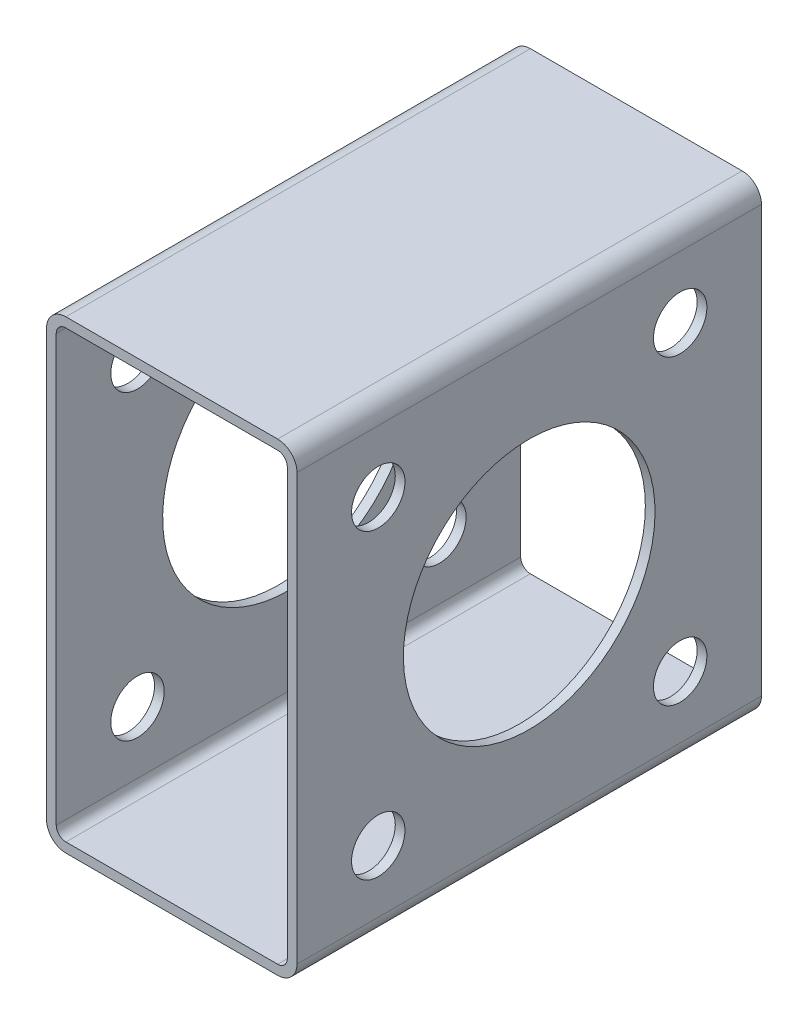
ISO-10303-21;
HEADER;
FILE_DESCRIPTION(('STEP AP214'),'2;1');
FILE_NAME('part.step','',(''),(''),'','','');
FILE_SCHEMA(('AUTOMOTIVE_DESIGN { 1 0 10303 214 1 1 1 1 }'));
ENDSEC;
DATA;
#1=APPLICATION_CONTEXT('core data for automotive mechanical design processes');
#2=APPLICATION_PROTOCOL_DEFINITION('international standard','automotive_design',2000,#1);
#3=PRODUCT_CONTEXT('',#1,'mechanical');
#4=PRODUCT('Part','Part','',(#3));
#5=PRODUCT_RELATED_PRODUCT_CATEGORY('part','',(#4));
#6=PRODUCT_DEFINITION_FORMATION('','',#4);
#7=PRODUCT_DEFINITION_CONTEXT('part definition',#1,'design');
#8=PRODUCT_DEFINITION('design','',#6,#7);
#9=PRODUCT_DEFINITION_SHAPE('','',#8);
#10=(LENGTH_UNIT() NAMED_UNIT(*) SI_UNIT(.MILLI.,.METRE.));
#11=(NAMED_UNIT(*) PLANE_ANGLE_UNIT() SI_UNIT($,.RADIAN.));
#12=(NAMED_UNIT(*) SI_UNIT($,.STERADIAN.) SOLID_ANGLE_UNIT());
#13=UNCERTAINTY_MEASURE_WITH_UNIT(LENGTH_MEASURE(1.E-05),#10,'distance_accuracy_value','');
#14=(GEOMETRIC_REPRESENTATION_CONTEXT(3) GLOBAL_UNCERTAINTY_ASSIGNED_CONTEXT((#13)) GLOBAL_UNIT_ASSIGNED_CONTEXT((#10,
#11,#12)) REPRESENTATION_CONTEXT('',''));
#15=CARTESIAN_POINT('',(0.,0.,0.));
#16=DIRECTION('',(0.,0.,1.));
#17=DIRECTION('',(1.,0.,0.));
#18=AXIS2_PLACEMENT_3D('',#15,#16,#17);
#19=CARTESIAN_POINT('',(-31.75,-69.85,152.4));
#20=DIRECTION('',(0.,0.,1.));
#21=DIRECTION('',(1.,0.,0.));
#22=AXIS2_PLACEMENT_3D('',#19,#20,#21);
#23=PLANE('',#22);
#24=CARTESIAN_POINT('',(-31.75,-69.85,152.4));
#25=DIRECTION('',(0.,0.,1.));
#26=DIRECTION('',(1.,0.,0.));
#27=AXIS2_PLACEMENT_3D('',#24,#25,#26);
#28=CIRCLE('',#27,6.35);
#29=CARTESIAN_POINT('',(-38.1,-69.85,152.4));
#30=VERTEX_POINT('',#29);
#31=CARTESIAN_POINT('',(-31.75,-76.2,152.4));
#32=VERTEX_POINT('',#31);
#33=EDGE_CURVE('E210',#30,#32,#28,.T.);
#34=ORIENTED_EDGE('',*,*,#33,.T.);
#35=DIRECTION('',(1.,0.,0.));
#36=VECTOR('',#35,1.);
#37=CARTESIAN_POINT('',(-31.75,-76.2,152.4));
#38=LINE('',#37,#36);
#39=CARTESIAN_POINT('',(37.719,-76.2,152.4));
#40=VERTEX_POINT('',#39);
#41=EDGE_CURVE('E213',#32,#40,#38,.T.);
#42=ORIENTED_EDGE('',*,*,#41,.T.);
#43=CARTESIAN_POINT('',(37.719,-69.85,152.4));
#44=DIRECTION('',(0.,0.,1.));
#45=DIRECTION('',(-1.,0.,0.));
#46=AXIS2_PLACEMENT_3D('',#43,#44,#45);
#47=CIRCLE('',#46,6.35);
#48=CARTESIAN_POINT('',(44.069,-69.85,152.4));
#49=VERTEX_POINT('',#48);
#50=EDGE_CURVE('E216',#40,#49,#47,.T.);
#51=ORIENTED_EDGE('',*,*,#50,.T.);
#52=DIRECTION('',(0.,1.,0.));
#53=VECTOR('',#52,1.);
#54=CARTESIAN_POINT('',(44.069,-69.85,152.4));
#55=LINE('',#54,#53);
#56=CARTESIAN_POINT('',(44.069,69.85,152.4));
#57=VERTEX_POINT('',#56);
#58=EDGE_CURVE('E218',#49,#57,#55,.T.);
#59=ORIENTED_EDGE('',*,*,#58,.T.);
#60=CARTESIAN_POINT('',(37.719,69.85,152.4));
#61=DIRECTION('',(0.,0.,1.));
#62=DIRECTION('',(1.,0.,0.));
#63=AXIS2_PLACEMENT_3D('',#60,#61,#62);
#64=CIRCLE('',#63,6.35);
#65=CARTESIAN_POINT('',(37.719,76.2,152.4));
#66=VERTEX_POINT('',#65);
#67=EDGE_CURVE('E220',#57,#66,#64,.T.);
#68=ORIENTED_EDGE('',*,*,#67,.T.);
#69=DIRECTION('',(-1.,0.,0.));
#70=VECTOR('',#69,1.);
#71=CARTESIAN_POINT('',(-31.75,76.2,152.4));
#72=LINE('',#71,#70);
#73=CARTESIAN_POINT('',(-31.75,76.2,152.4));
#74=VERTEX_POINT('',#73);
#75=EDGE_CURVE('E222',#66,#74,#72,.T.);
#76=ORIENTED_EDGE('',*,*,#75,.T.);
#77=CARTESIAN_POINT('',(-31.75,69.85,152.4));
#78=DIRECTION('',(0.,0.,1.));
#79=DIRECTION('',(1.,0.,0.));
#80=AXIS2_PLACEMENT_3D('',#77,#78,#79);
#81=CIRCLE('',#80,6.34999999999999);
#82=CARTESIAN_POINT('',(-38.1,69.85,152.4));
#83=VERTEX_POINT('',#82);
#84=EDGE_CURVE('E224',#74,#83,#81,.T.);
#85=ORIENTED_EDGE('',*,*,#84,.T.);
#86=DIRECTION('',(0.,-1.,0.));
#87=VECTOR('',#86,1.);
#88=CARTESIAN_POINT('',(-38.1,-69.85,152.4));
#89=LINE('',#88,#87);
#90=EDGE_CURVE('E226',#83,#30,#89,.T.);
#91=ORIENTED_EDGE('',*,*,#90,.T.);
#92=EDGE_LOOP('',(#34,#42,#51,#59,#68,#76,#85,#91));
#93=FACE_BOUND('',#92,.T.);
#94=DIRECTION('',(1.,0.,0.));
#95=VECTOR('',#94,1.);
#96=CARTESIAN_POINT('',(-31.75,-73.025,152.4));
#97=LINE('',#96,#95);
#98=CARTESIAN_POINT('',(-31.75,-73.025,152.4));
#99=VERTEX_POINT('',#98);
#100=CARTESIAN_POINT('',(37.719,-73.025,152.4));
#101=VERTEX_POINT('',#100);
#102=EDGE_CURVE('E151',#99,#101,#97,.T.);
#103=ORIENTED_EDGE('',*,*,#102,.F.);
#104=CARTESIAN_POINT('',(-31.75,-69.85,152.4));
#105=DIRECTION('',(0.,0.,1.));
#106=DIRECTION('',(1.,0.,0.));
#107=AXIS2_PLACEMENT_3D('',#104,#105,#106);
#108=CIRCLE('',#107,3.17500000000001);
#109=CARTESIAN_POINT('',(-34.925,-69.85,152.4));
#110=VERTEX_POINT('',#109);
#111=EDGE_CURVE('E143',#110,#99,#108,.T.);
#112=ORIENTED_EDGE('',*,*,#111,.F.);
#113=DIRECTION('',(0.,-1.,0.));
#114=VECTOR('',#113,1.);
#115=CARTESIAN_POINT('',(-34.925,-69.85,152.4));
#116=LINE('',#115,#114);
#117=CARTESIAN_POINT('',(-34.925,69.85,152.4));
#118=VERTEX_POINT('',#117);
#119=EDGE_CURVE('E177',#118,#110,#116,.T.);
#120=ORIENTED_EDGE('',*,*,#119,.F.);
#121=CARTESIAN_POINT('',(-31.75,69.85,152.4));
#122=DIRECTION('',(0.,0.,1.));
#123=DIRECTION('',(1.,0.,0.));
#124=AXIS2_PLACEMENT_3D('',#121,#122,#123);
#125=CIRCLE('',#124,3.175);
#126=CARTESIAN_POINT('',(-31.75,73.025,152.4));
#127=VERTEX_POINT('',#126);
#128=EDGE_CURVE('E175',#127,#118,#125,.T.);
#129=ORIENTED_EDGE('',*,*,#128,.F.);
#130=DIRECTION('',(-1.,0.,0.));
#131=VECTOR('',#130,1.);
#132=CARTESIAN_POINT('',(-31.75,73.025,152.4));
#133=LINE('',#132,#131);
#134=CARTESIAN_POINT('',(37.719,73.025,152.4));
#135=VERTEX_POINT('',#134);
#136=EDGE_CURVE('E173',#135,#127,#133,.T.);
#137=ORIENTED_EDGE('',*,*,#136,.F.);
#138=CARTESIAN_POINT('',(37.719,69.85,152.4));
#139=DIRECTION('',(0.,0.,1.));
#140=DIRECTION('',(1.,0.,0.));
#141=AXIS2_PLACEMENT_3D('',#138,#139,#140);
#142=CIRCLE('',#141,3.175);
#143=CARTESIAN_POINT('',(40.894,69.85,152.4));
#144=VERTEX_POINT('',#143);
#145=EDGE_CURVE('E171',#144,#135,#142,.T.);
#146=ORIENTED_EDGE('',*,*,#145,.F.);
#147=DIRECTION('',(0.,1.,0.));
#148=VECTOR('',#147,1.);
#149=CARTESIAN_POINT('',(40.894,-69.85,152.4));
#150=LINE('',#149,#148);
#151=CARTESIAN_POINT('',(40.894,-69.85,152.4));
#152=VERTEX_POINT('',#151);
#153=EDGE_CURVE('E166',#152,#144,#150,.T.);
#154=ORIENTED_EDGE('',*,*,#153,.F.);
#155=CARTESIAN_POINT('',(37.719,-69.85,152.4));
#156=DIRECTION('',(0.,0.,1.));
#157=DIRECTION('',(-1.,0.,0.));
#158=AXIS2_PLACEMENT_3D('',#155,#156,#157);
#159=CIRCLE('',#158,3.17499999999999);
#160=EDGE_CURVE('E164',#101,#152,#159,.T.);
#161=ORIENTED_EDGE('',*,*,#160,.F.);
#162=EDGE_LOOP('',(#103,#112,#120,#129,#137,#146,#154,#161));
#163=FACE_BOUND('',#162,.T.);
#164=ADVANCED_FACE('F30',(#93,#163),#23,.T.);
#165=CARTESIAN_POINT('',(-31.75,-69.85,0.));
#166=DIRECTION('',(0.,0.,1.));
#167=DIRECTION('',(1.,0.,0.));
#168=AXIS2_PLACEMENT_3D('',#165,#166,#167);
#169=PLANE('',#168);
#170=CARTESIAN_POINT('',(-31.75,-69.85,0.));
#171=DIRECTION('',(0.,0.,1.));
#172=DIRECTION('',(1.,0.,0.));
#173=AXIS2_PLACEMENT_3D('',#170,#171,#172);
#174=CIRCLE('',#173,6.35);
#175=CARTESIAN_POINT('',(-38.1,-69.85,0.));
#176=VERTEX_POINT('',#175);
#177=CARTESIAN_POINT('',(-31.75,-76.2,0.));
#178=VERTEX_POINT('',#177);
#179=EDGE_CURVE('E159',#176,#178,#174,.T.);
#180=ORIENTED_EDGE('',*,*,#179,.F.);
#181=DIRECTION('',(0.,-1.,0.));
#182=VECTOR('',#181,1.);
#183=CARTESIAN_POINT('',(-38.1,-69.85,0.));
#184=LINE('',#183,#182);
#185=CARTESIAN_POINT('',(-38.1,69.85,0.));
#186=VERTEX_POINT('',#185);
#187=EDGE_CURVE('E214',#186,#176,#184,.T.);
#188=ORIENTED_EDGE('',*,*,#187,.F.);
#189=CARTESIAN_POINT('',(-31.75,69.85,0.));
#190=DIRECTION('',(0.,0.,1.));
#191=DIRECTION('',(1.,0.,0.));
#192=AXIS2_PLACEMENT_3D('',#189,#190,#191);
#193=CIRCLE('',#192,6.34999999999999);
#194=CARTESIAN_POINT('',(-31.75,76.2,0.));
#195=VERTEX_POINT('',#194);
#196=EDGE_CURVE('E241',#195,#186,#193,.T.);
#197=ORIENTED_EDGE('',*,*,#196,.F.);
#198=DIRECTION('',(-1.,0.,0.));
#199=VECTOR('',#198,1.);
#200=CARTESIAN_POINT('',(-31.75,76.2,0.));
#201=LINE('',#200,#199);
#202=CARTESIAN_POINT('',(37.719,76.2,0.));
#203=VERTEX_POINT('',#202);
#204=EDGE_CURVE('E239',#203,#195,#201,.T.);
#205=ORIENTED_EDGE('',*,*,#204,.F.);
#206=CARTESIAN_POINT('',(37.719,69.85,0.));
#207=DIRECTION('',(0.,0.,1.));
#208=DIRECTION('',(1.,0.,0.));
#209=AXIS2_PLACEMENT_3D('',#206,#207,#208);
#210=CIRCLE('',#209,6.35);
#211=CARTESIAN_POINT('',(44.069,69.85,0.));
#212=VERTEX_POINT('',#211);
#213=EDGE_CURVE('E237',#212,#203,#210,.T.);
#214=ORIENTED_EDGE('',*,*,#213,.F.);
#215=DIRECTION('',(0.,1.,0.));
#216=VECTOR('',#215,1.);
#217=CARTESIAN_POINT('',(44.069,-69.85,0.));
#218=LINE('',#217,#216);
#219=CARTESIAN_POINT('',(44.069,-69.85,0.));
#220=VERTEX_POINT('',#219);
#221=EDGE_CURVE('E235',#220,#212,#218,.T.);
#222=ORIENTED_EDGE('',*,*,#221,.F.);
#223=CARTESIAN_POINT('',(37.719,-69.85,0.));
#224=DIRECTION('',(0.,0.,1.));
#225=DIRECTION('',(-1.,0.,0.));
#226=AXIS2_PLACEMENT_3D('',#223,#224,#225);
#227=CIRCLE('',#226,6.35);
#228=CARTESIAN_POINT('',(37.719,-76.2,0.));
#229=VERTEX_POINT('',#228);
#230=EDGE_CURVE('E233',#229,#220,#227,.T.);
#231=ORIENTED_EDGE('',*,*,#230,.F.);
#232=DIRECTION('',(1.,0.,0.));
#233=VECTOR('',#232,1.);
#234=CARTESIAN_POINT('',(-31.75,-76.2,0.));
#235=LINE('',#234,#233);
#236=EDGE_CURVE('E231',#178,#229,#235,.T.);
#237=ORIENTED_EDGE('',*,*,#236,.F.);
#238=EDGE_LOOP('',(#180,#188,#197,#205,#214,#222,#231,#237));
#239=FACE_BOUND('',#238,.T.);
#240=CARTESIAN_POINT('',(-31.75,-69.85,0.));
#241=DIRECTION('',(0.,0.,1.));
#242=DIRECTION('',(1.,0.,0.));
#243=AXIS2_PLACEMENT_3D('',#240,#241,#242);
#244=CIRCLE('',#243,3.17500000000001);
#245=CARTESIAN_POINT('',(-34.925,-69.85,0.));
#246=VERTEX_POINT('',#245);
#247=CARTESIAN_POINT('',(-31.75,-73.025,0.));
#248=VERTEX_POINT('',#247);
#249=EDGE_CURVE('E53',#246,#248,#244,.T.);
#250=ORIENTED_EDGE('',*,*,#249,.T.);
#251=DIRECTION('',(1.,0.,0.));
#252=VECTOR('',#251,1.);
#253=CARTESIAN_POINT('',(-31.75,-73.025,0.));
#254=LINE('',#253,#252);
#255=CARTESIAN_POINT('',(37.719,-73.025,0.));
#256=VERTEX_POINT('',#255);
#257=EDGE_CURVE('E158',#248,#256,#254,.T.);
#258=ORIENTED_EDGE('',*,*,#257,.T.);
#259=CARTESIAN_POINT('',(37.719,-69.85,0.));
#260=DIRECTION('',(0.,0.,1.));
#261=DIRECTION('',(-1.,0.,0.));
#262=AXIS2_PLACEMENT_3D('',#259,#260,#261);
#263=CIRCLE('',#262,3.17499999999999);
#264=CARTESIAN_POINT('',(40.894,-69.85,0.));
#265=VERTEX_POINT('',#264);
#266=EDGE_CURVE('E182',#256,#265,#263,.T.);
#267=ORIENTED_EDGE('',*,*,#266,.T.);
#268=DIRECTION('',(0.,1.,0.));
#269=VECTOR('',#268,1.);
#270=CARTESIAN_POINT('',(40.894,-69.85,0.));
#271=LINE('',#270,#269);
#272=CARTESIAN_POINT('',(40.894,69.85,0.));
#273=VERTEX_POINT('',#272);
#274=EDGE_CURVE('E185',#265,#273,#271,.T.);
#275=ORIENTED_EDGE('',*,*,#274,.T.);
#276=CARTESIAN_POINT('',(37.719,69.85,0.));
#277=DIRECTION('',(0.,0.,1.));
#278=DIRECTION('',(1.,0.,0.));
#279=AXIS2_PLACEMENT_3D('',#276,#277,#278);
#280=CIRCLE('',#279,3.175);
#281=CARTESIAN_POINT('',(37.719,73.025,0.));
#282=VERTEX_POINT('',#281);
#283=EDGE_CURVE('E188',#273,#282,#280,.T.);
#284=ORIENTED_EDGE('',*,*,#283,.T.);
#285=DIRECTION('',(-1.,0.,0.));
#286=VECTOR('',#285,1.);
#287=CARTESIAN_POINT('',(-31.75,73.025,0.));
#288=LINE('',#287,#286);
#289=CARTESIAN_POINT('',(-31.75,73.025,0.));
#290=VERTEX_POINT('',#289);
#291=EDGE_CURVE('E191',#282,#290,#288,.T.);
#292=ORIENTED_EDGE('',*,*,#291,.T.);
#293=CARTESIAN_POINT('',(-31.75,69.85,0.));
#294=DIRECTION('',(0.,0.,1.));
#295=DIRECTION('',(1.,0.,0.));
#296=AXIS2_PLACEMENT_3D('',#293,#294,#295);
#297=CIRCLE('',#296,3.175);
#298=CARTESIAN_POINT('',(-34.925,69.85,0.));
#299=VERTEX_POINT('',#298);
#300=EDGE_CURVE('E194',#290,#299,#297,.T.);
#301=ORIENTED_EDGE('',*,*,#300,.T.);
#302=DIRECTION('',(0.,-1.,0.));
#303=VECTOR('',#302,1.);
#304=CARTESIAN_POINT('',(-34.925,-69.85,0.));
#305=LINE('',#304,#303);
#306=EDGE_CURVE('E152',#299,#246,#305,.T.);
#307=ORIENTED_EDGE('',*,*,#306,.T.);
#308=EDGE_LOOP('',(#250,#258,#267,#275,#284,#292,#301,#307));
#309=FACE_BOUND('',#308,.T.);
#310=ADVANCED_FACE('F271',(#239,#309),#169,.F.);
#311=CARTESIAN_POINT('',(-31.75,-69.85,152.4));
#312=DIRECTION('',(0.,0.,-1.));
#313=DIRECTION('',(-1.,0.,0.));
#314=AXIS2_PLACEMENT_3D('',#311,#312,#313);
#315=CYLINDRICAL_SURFACE('',#314,6.35);
#316=ORIENTED_EDGE('',*,*,#179,.T.);
#317=DIRECTION('',(0.,0.,-1.));
#318=VECTOR('',#317,1.);
#319=CARTESIAN_POINT('',(-31.75,-76.2,152.4));
#320=LINE('',#319,#318);
#321=EDGE_CURVE('E11',#32,#178,#320,.T.);
#322=ORIENTED_EDGE('',*,*,#321,.F.);
#323=ORIENTED_EDGE('',*,*,#33,.F.);
#324=DIRECTION('',(0.,0.,-1.));
#325=VECTOR('',#324,1.);
#326=CARTESIAN_POINT('',(-38.1,-69.85,152.4));
#327=LINE('',#326,#325);
#328=EDGE_CURVE('E228',#30,#176,#327,.T.);
#329=ORIENTED_EDGE('',*,*,#328,.T.);
#330=EDGE_LOOP('',(#316,#322,#323,#329));
#331=FACE_BOUND('',#330,.T.);
#332=ADVANCED_FACE('F32',(#331),#315,.T.);
#333=CARTESIAN_POINT('',(-31.75,-76.2,152.4));
#334=DIRECTION('',(0.,1.,0.));
#335=DIRECTION('',(0.,0.,1.));
#336=AXIS2_PLACEMENT_3D('',#333,#334,#335);
#337=PLANE('',#336);
#338=ORIENTED_EDGE('',*,*,#236,.T.);
#339=DIRECTION('',(0.,0.,-1.));
#340=VECTOR('',#339,1.);
#341=CARTESIAN_POINT('',(37.719,-76.2,152.4));
#342=LINE('',#341,#340);
#343=EDGE_CURVE('E38',#40,#229,#342,.T.);
#344=ORIENTED_EDGE('',*,*,#343,.F.);
#345=ORIENTED_EDGE('',*,*,#41,.F.);
#346=ORIENTED_EDGE('',*,*,#321,.T.);
#347=EDGE_LOOP('',(#338,#344,#345,#346));
#348=FACE_BOUND('',#347,.T.);
#349=ADVANCED_FACE('F288',(#348),#337,.F.);
#350=CARTESIAN_POINT('',(37.719,-69.85,152.4));
#351=DIRECTION('',(0.,0.,-1.));
#352=DIRECTION('',(-1.,0.,0.));
#353=AXIS2_PLACEMENT_3D('',#350,#351,#352);
#354=CYLINDRICAL_SURFACE('',#353,6.35);
#355=ORIENTED_EDGE('',*,*,#230,.T.);
#356=DIRECTION('',(0.,0.,-1.));
#357=VECTOR('',#356,1.);
#358=CARTESIAN_POINT('',(44.069,-69.85,152.4));
#359=LINE('',#358,#357);
#360=EDGE_CURVE('E258',#49,#220,#359,.T.);
#361=ORIENTED_EDGE('',*,*,#360,.F.);
#362=ORIENTED_EDGE('',*,*,#50,.F.);
#363=ORIENTED_EDGE('',*,*,#343,.T.);
#364=EDGE_LOOP('',(#355,#361,#362,#363));
#365=FACE_BOUND('',#364,.T.);
#366=ADVANCED_FACE('F265',(#365),#354,.T.);
#367=CARTESIAN_POINT('',(44.069,-69.85,152.4));
#368=DIRECTION('',(-1.,0.,0.));
#369=DIRECTION('',(0.,-1.,0.));
#370=AXIS2_PLACEMENT_3D('',#367,#368,#369);
#371=PLANE('',#370);
#372=CARTESIAN_POINT('',(44.069,-49.53,26.67));
#373=DIRECTION('',(1.,0.,0.));
#374=DIRECTION('',(0.,1.,0.));
#375=AXIS2_PLACEMENT_3D('',#372,#373,#374);
#376=CIRCLE('',#375,8.76299999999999);
#377=CARTESIAN_POINT('',(44.069,-40.767,26.67));
#378=VERTEX_POINT('',#377);
#379=EDGE_CURVE('E348',#378,#378,#376,.T.);
#380=ORIENTED_EDGE('',*,*,#379,.F.);
#381=EDGE_LOOP('',(#380));
#382=FACE_BOUND('',#381,.T.);
#383=CARTESIAN_POINT('',(44.069,-49.53,125.73));
#384=DIRECTION('',(1.,0.,0.));
#385=DIRECTION('',(0.,1.,0.));
#386=AXIS2_PLACEMENT_3D('',#383,#384,#385);
#387=CIRCLE('',#386,8.76299999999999);
#388=CARTESIAN_POINT('',(44.069,-40.767,125.73));
#389=VERTEX_POINT('',#388);
#390=EDGE_CURVE('E361',#389,#389,#387,.T.);
#391=ORIENTED_EDGE('',*,*,#390,.F.);
#392=EDGE_LOOP('',(#391));
#393=FACE_BOUND('',#392,.T.);
#394=CARTESIAN_POINT('',(44.069,49.53,26.67));
#395=DIRECTION('',(1.,0.,0.));
#396=DIRECTION('',(0.,1.,0.));
#397=AXIS2_PLACEMENT_3D('',#394,#395,#396);
#398=CIRCLE('',#397,8.76299999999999);
#399=CARTESIAN_POINT('',(44.069,58.293,26.67));
#400=VERTEX_POINT('',#399);
#401=EDGE_CURVE('E367',#400,#400,#398,.T.);
#402=ORIENTED_EDGE('',*,*,#401,.F.);
#403=EDGE_LOOP('',(#402));
#404=FACE_BOUND('',#403,.T.);
#405=CARTESIAN_POINT('',(44.069,49.53,125.73));
#406=DIRECTION('',(1.,0.,0.));
#407=DIRECTION('',(0.,1.,0.));
#408=AXIS2_PLACEMENT_3D('',#405,#406,#407);
#409=CIRCLE('',#408,8.76299999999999);
#410=CARTESIAN_POINT('',(44.069,58.293,125.73));
#411=VERTEX_POINT('',#410);
#412=EDGE_CURVE('E373',#411,#411,#409,.T.);
#413=ORIENTED_EDGE('',*,*,#412,.F.);
#414=EDGE_LOOP('',(#413));
#415=FACE_BOUND('',#414,.T.);
#416=CARTESIAN_POINT('',(44.069,0.,76.2));
#417=DIRECTION('',(1.,0.,0.));
#418=DIRECTION('',(0.,1.,0.));
#419=AXIS2_PLACEMENT_3D('',#416,#417,#418);
#420=CIRCLE('',#419,41.275);
#421=CARTESIAN_POINT('',(44.069,41.275,76.2));
#422=VERTEX_POINT('',#421);
#423=EDGE_CURVE('E180',#422,#422,#420,.T.);
#424=ORIENTED_EDGE('',*,*,#423,.F.);
#425=EDGE_LOOP('',(#424));
#426=FACE_BOUND('',#425,.T.);
#427=ORIENTED_EDGE('',*,*,#221,.T.);
#428=DIRECTION('',(0.,0.,-1.));
#429=VECTOR('',#428,1.);
#430=CARTESIAN_POINT('',(44.069,69.85,152.4));
#431=LINE('',#430,#429);
#432=EDGE_CURVE('E255',#57,#212,#431,.T.);
#433=ORIENTED_EDGE('',*,*,#432,.F.);
#434=ORIENTED_EDGE('',*,*,#58,.F.);
#435=ORIENTED_EDGE('',*,*,#360,.T.);
#436=EDGE_LOOP('',(#427,#433,#434,#435));
#437=FACE_BOUND('',#436,.T.);
#438=ADVANCED_FACE('F277',(#382,#393,#404,#415,#426,#437),#371,.F.);
#439=CARTESIAN_POINT('',(37.719,69.85,152.4));
#440=DIRECTION('',(0.,0.,-1.));
#441=DIRECTION('',(-1.,0.,0.));
#442=AXIS2_PLACEMENT_3D('',#439,#440,#441);
#443=CYLINDRICAL_SURFACE('',#442,6.35);
#444=ORIENTED_EDGE('',*,*,#213,.T.);
#445=DIRECTION('',(0.,0.,-1.));
#446=VECTOR('',#445,1.);
#447=CARTESIAN_POINT('',(37.719,76.2,152.4));
#448=LINE('',#447,#446);
#449=EDGE_CURVE('E252',#66,#203,#448,.T.);
#450=ORIENTED_EDGE('',*,*,#449,.F.);
#451=ORIENTED_EDGE('',*,*,#67,.F.);
#452=ORIENTED_EDGE('',*,*,#432,.T.);
#453=EDGE_LOOP('',(#444,#450,#451,#452));
#454=FACE_BOUND('',#453,.T.);
#455=ADVANCED_FACE('F281',(#454),#443,.T.);
#456=CARTESIAN_POINT('',(-31.75,76.2,152.4));
#457=DIRECTION('',(0.,-1.,0.));
#458=DIRECTION('',(0.,0.,-1.));
#459=AXIS2_PLACEMENT_3D('',#456,#457,#458);
#460=PLANE('',#459);
#461=ORIENTED_EDGE('',*,*,#204,.T.);
#462=DIRECTION('',(0.,0.,-1.));
#463=VECTOR('',#462,1.);
#464=CARTESIAN_POINT('',(-31.75,76.2,152.4));
#465=LINE('',#464,#463);
#466=EDGE_CURVE('E249',#74,#195,#465,.T.);
#467=ORIENTED_EDGE('',*,*,#466,.F.);
#468=ORIENTED_EDGE('',*,*,#75,.F.);
#469=ORIENTED_EDGE('',*,*,#449,.T.);
#470=EDGE_LOOP('',(#461,#467,#468,#469));
#471=FACE_BOUND('',#470,.T.);
#472=ADVANCED_FACE('F301',(#471),#460,.F.);
#473=CARTESIAN_POINT('',(-31.75,69.85,152.4));
#474=DIRECTION('',(0.,0.,-1.));
#475=DIRECTION('',(-1.,0.,0.));
#476=AXIS2_PLACEMENT_3D('',#473,#474,#475);
#477=CYLINDRICAL_SURFACE('',#476,6.34999999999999);
#478=ORIENTED_EDGE('',*,*,#196,.T.);
#479=DIRECTION('',(0.,0.,-1.));
#480=VECTOR('',#479,1.);
#481=CARTESIAN_POINT('',(-38.1,69.85,152.4));
#482=LINE('',#481,#480);
#483=EDGE_CURVE('E246',#83,#186,#482,.T.);
#484=ORIENTED_EDGE('',*,*,#483,.F.);
#485=ORIENTED_EDGE('',*,*,#84,.F.);
#486=ORIENTED_EDGE('',*,*,#466,.T.);
#487=EDGE_LOOP('',(#478,#484,#485,#486));
#488=FACE_BOUND('',#487,.T.);
#489=ADVANCED_FACE('F299',(#488),#477,.T.);
#490=CARTESIAN_POINT('',(-38.1,-69.85,152.4));
#491=DIRECTION('',(1.,0.,0.));
#492=DIRECTION('',(0.,1.,0.));
#493=AXIS2_PLACEMENT_3D('',#490,#491,#492);
#494=PLANE('',#493);
#495=CARTESIAN_POINT('',(-38.1,-49.53,125.73));
#496=DIRECTION('',(-1.,0.,0.));
#497=DIRECTION('',(0.,-1.,0.));
#498=AXIS2_PLACEMENT_3D('',#495,#496,#497);
#499=CIRCLE('',#498,8.76299999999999);
#500=CARTESIAN_POINT('',(-38.1,-58.2929999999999,125.73));
#501=VERTEX_POINT('',#500);
#502=EDGE_CURVE('E327',#501,#501,#499,.T.);
#503=ORIENTED_EDGE('',*,*,#502,.F.);
#504=EDGE_LOOP('',(#503));
#505=FACE_BOUND('',#504,.T.);
#506=CARTESIAN_POINT('',(-38.1,-49.53,26.67));
#507=DIRECTION('',(-1.,0.,0.));
#508=DIRECTION('',(0.,-1.,0.));
#509=AXIS2_PLACEMENT_3D('',#506,#507,#508);
#510=CIRCLE('',#509,8.76299999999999);
#511=CARTESIAN_POINT('',(-38.1,-58.2929999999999,26.67));
#512=VERTEX_POINT('',#511);
#513=EDGE_CURVE('E331',#512,#512,#510,.T.);
#514=ORIENTED_EDGE('',*,*,#513,.F.);
#515=EDGE_LOOP('',(#514));
#516=FACE_BOUND('',#515,.T.);
#517=CARTESIAN_POINT('',(-38.1,49.53,125.73));
#518=DIRECTION('',(-1.,0.,0.));
#519=DIRECTION('',(0.,-1.,0.));
#520=AXIS2_PLACEMENT_3D('',#517,#518,#519);
#521=CIRCLE('',#520,8.76299999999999);
#522=CARTESIAN_POINT('',(-38.1,40.7670000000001,125.73));
#523=VERTEX_POINT('',#522);
#524=EDGE_CURVE('E335',#523,#523,#521,.T.);
#525=ORIENTED_EDGE('',*,*,#524,.F.);
#526=EDGE_LOOP('',(#525));
#527=FACE_BOUND('',#526,.T.);
#528=CARTESIAN_POINT('',(-38.1,49.53,26.67));
#529=DIRECTION('',(-1.,0.,0.));
#530=DIRECTION('',(0.,-1.,0.));
#531=AXIS2_PLACEMENT_3D('',#528,#529,#530);
#532=CIRCLE('',#531,8.76299999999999);
#533=CARTESIAN_POINT('',(-38.1,40.7670000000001,26.67));
#534=VERTEX_POINT('',#533);
#535=EDGE_CURVE('E339',#534,#534,#532,.T.);
#536=ORIENTED_EDGE('',*,*,#535,.F.);
#537=EDGE_LOOP('',(#536));
#538=FACE_BOUND('',#537,.T.);
#539=CARTESIAN_POINT('',(-38.1,0.,76.2));
#540=DIRECTION('',(-1.,0.,0.));
#541=DIRECTION('',(0.,-1.,0.));
#542=AXIS2_PLACEMENT_3D('',#539,#540,#541);
#543=CIRCLE('',#542,41.275);
#544=CARTESIAN_POINT('',(-38.1,-41.275,76.2));
#545=VERTEX_POINT('',#544);
#546=EDGE_CURVE('E342',#545,#545,#543,.T.);
#547=ORIENTED_EDGE('',*,*,#546,.F.);
#548=EDGE_LOOP('',(#547));
#549=FACE_BOUND('',#548,.T.);
#550=ORIENTED_EDGE('',*,*,#187,.T.);
#551=ORIENTED_EDGE('',*,*,#328,.F.);
#552=ORIENTED_EDGE('',*,*,#90,.F.);
#553=ORIENTED_EDGE('',*,*,#483,.T.);
#554=EDGE_LOOP('',(#550,#551,#552,#553));
#555=FACE_BOUND('',#554,.T.);
#556=ADVANCED_FACE('F294',(#505,#516,#527,#538,#549,#555),#494,.F.);
#557=CARTESIAN_POINT('',(-31.75,-69.85,152.4));
#558=DIRECTION('',(0.,0.,-1.));
#559=DIRECTION('',(-1.,0.,0.));
#560=AXIS2_PLACEMENT_3D('',#557,#558,#559);
#561=CYLINDRICAL_SURFACE('',#560,3.17500000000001);
#562=ORIENTED_EDGE('',*,*,#249,.F.);
#563=DIRECTION('',(0.,0.,-1.));
#564=VECTOR('',#563,1.);
#565=CARTESIAN_POINT('',(-34.925,-69.85,152.4));
#566=LINE('',#565,#564);
#567=EDGE_CURVE('E147',#110,#246,#566,.T.);
#568=ORIENTED_EDGE('',*,*,#567,.F.);
#569=ORIENTED_EDGE('',*,*,#111,.T.);
#570=DIRECTION('',(0.,0.,-1.));
#571=VECTOR('',#570,1.);
#572=CARTESIAN_POINT('',(-31.75,-73.025,152.4));
#573=LINE('',#572,#571);
#574=EDGE_CURVE('E146',#99,#248,#573,.T.);
#575=ORIENTED_EDGE('',*,*,#574,.T.);
#576=EDGE_LOOP('',(#562,#568,#569,#575));
#577=FACE_BOUND('',#576,.T.);
#578=ADVANCED_FACE('F145',(#577),#561,.F.);
#579=CARTESIAN_POINT('',(-31.75,-73.025,152.4));
#580=DIRECTION('',(0.,1.,0.));
#581=DIRECTION('',(-1.,0.,0.));
#582=AXIS2_PLACEMENT_3D('',#579,#580,#581);
#583=PLANE('',#582);
#584=ORIENTED_EDGE('',*,*,#257,.F.);
#585=ORIENTED_EDGE('',*,*,#574,.F.);
#586=ORIENTED_EDGE('',*,*,#102,.T.);
#587=DIRECTION('',(0.,0.,-1.));
#588=VECTOR('',#587,1.);
#589=CARTESIAN_POINT('',(37.719,-73.025,152.4));
#590=LINE('',#589,#588);
#591=EDGE_CURVE('E160',#101,#256,#590,.T.);
#592=ORIENTED_EDGE('',*,*,#591,.T.);
#593=EDGE_LOOP('',(#584,#585,#586,#592));
#594=FACE_BOUND('',#593,.T.);
#595=ADVANCED_FACE('F155',(#594),#583,.T.);
#596=CARTESIAN_POINT('',(37.719,-69.85,152.4));
#597=DIRECTION('',(0.,0.,-1.));
#598=DIRECTION('',(-1.,0.,0.));
#599=AXIS2_PLACEMENT_3D('',#596,#597,#598);
#600=CYLINDRICAL_SURFACE('',#599,3.17499999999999);
#601=ORIENTED_EDGE('',*,*,#266,.F.);
#602=ORIENTED_EDGE('',*,*,#591,.F.);
#603=ORIENTED_EDGE('',*,*,#160,.T.);
#604=DIRECTION('',(0.,0.,-1.));
#605=VECTOR('',#604,1.);
#606=CARTESIAN_POINT('',(40.894,-69.85,152.4));
#607=LINE('',#606,#605);
#608=EDGE_CURVE('E207',#152,#265,#607,.T.);
#609=ORIENTED_EDGE('',*,*,#608,.T.);
#610=EDGE_LOOP('',(#601,#602,#603,#609));
#611=FACE_BOUND('',#610,.T.);
#612=ADVANCED_FACE('F458',(#611),#600,.F.);
#613=CARTESIAN_POINT('',(40.894,-69.85,152.4));
#614=DIRECTION('',(-1.,0.,0.));
#615=DIRECTION('',(0.,-1.,0.));
#616=AXIS2_PLACEMENT_3D('',#613,#614,#615);
#617=PLANE('',#616);
#618=CARTESIAN_POINT('',(40.894,-49.53,26.67));
#619=DIRECTION('',(-1.,0.,0.));
#620=DIRECTION('',(0.,-1.,0.));
#621=AXIS2_PLACEMENT_3D('',#618,#619,#620);
#622=CIRCLE('',#621,8.76299999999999);
#623=CARTESIAN_POINT('',(40.894,-58.293,26.67));
#624=VERTEX_POINT('',#623);
#625=EDGE_CURVE('E344',#624,#624,#622,.F.);
#626=ORIENTED_EDGE('',*,*,#625,.T.);
#627=EDGE_LOOP('',(#626));
#628=FACE_BOUND('',#627,.T.);
#629=CARTESIAN_POINT('',(40.894,-49.53,125.73));
#630=DIRECTION('',(-1.,0.,0.));
#631=DIRECTION('',(0.,-1.,0.));
#632=AXIS2_PLACEMENT_3D('',#629,#630,#631);
#633=CIRCLE('',#632,8.76299999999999);
#634=CARTESIAN_POINT('',(40.894,-58.293,125.73));
#635=VERTEX_POINT('',#634);
#636=EDGE_CURVE('E358',#635,#635,#633,.F.);
#637=ORIENTED_EDGE('',*,*,#636,.T.);
#638=EDGE_LOOP('',(#637));
#639=FACE_BOUND('',#638,.T.);
#640=CARTESIAN_POINT('',(40.894,49.53,26.67));
#641=DIRECTION('',(-1.,0.,0.));
#642=DIRECTION('',(0.,-1.,0.));
#643=AXIS2_PLACEMENT_3D('',#640,#641,#642);
#644=CIRCLE('',#643,8.76299999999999);
#645=CARTESIAN_POINT('',(40.894,40.767,26.67));
#646=VERTEX_POINT('',#645);
#647=EDGE_CURVE('E364',#646,#646,#644,.F.);
#648=ORIENTED_EDGE('',*,*,#647,.T.);
#649=EDGE_LOOP('',(#648));
#650=FACE_BOUND('',#649,.T.);
#651=CARTESIAN_POINT('',(40.894,49.53,125.73));
#652=DIRECTION('',(-1.,0.,0.));
#653=DIRECTION('',(0.,-1.,0.));
#654=AXIS2_PLACEMENT_3D('',#651,#652,#653);
#655=CIRCLE('',#654,8.76299999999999);
#656=CARTESIAN_POINT('',(40.894,40.767,125.73));
#657=VERTEX_POINT('',#656);
#658=EDGE_CURVE('E370',#657,#657,#655,.F.);
#659=ORIENTED_EDGE('',*,*,#658,.T.);
#660=EDGE_LOOP('',(#659));
#661=FACE_BOUND('',#660,.T.);
#662=CARTESIAN_POINT('',(40.894,0.,76.2));
#663=DIRECTION('',(-1.,0.,0.));
#664=DIRECTION('',(0.,-1.,0.));
#665=AXIS2_PLACEMENT_3D('',#662,#663,#664);
#666=CIRCLE('',#665,41.275);
#667=CARTESIAN_POINT('',(40.894,-41.275,76.2));
#668=VERTEX_POINT('',#667);
#669=EDGE_CURVE('E376',#668,#668,#666,.F.);
#670=ORIENTED_EDGE('',*,*,#669,.T.);
#671=EDGE_LOOP('',(#670));
#672=FACE_BOUND('',#671,.T.);
#673=ORIENTED_EDGE('',*,*,#274,.F.);
#674=ORIENTED_EDGE('',*,*,#608,.F.);
#675=ORIENTED_EDGE('',*,*,#153,.T.);
#676=DIRECTION('',(0.,0.,-1.));
#677=VECTOR('',#676,1.);
#678=CARTESIAN_POINT('',(40.894,69.85,152.4));
#679=LINE('',#678,#677);
#680=EDGE_CURVE('E205',#144,#273,#679,.T.);
#681=ORIENTED_EDGE('',*,*,#680,.T.);
#682=EDGE_LOOP('',(#673,#674,#675,#681));
#683=FACE_BOUND('',#682,.T.);
#684=ADVANCED_FACE('F465',(#628,#639,#650,#661,#672,#683),#617,.T.);
#685=CARTESIAN_POINT('',(37.719,69.85,152.4));
#686=DIRECTION('',(0.,0.,-1.));
#687=DIRECTION('',(-1.,0.,0.));
#688=AXIS2_PLACEMENT_3D('',#685,#686,#687);
#689=CYLINDRICAL_SURFACE('',#688,3.175);
#690=ORIENTED_EDGE('',*,*,#283,.F.);
#691=ORIENTED_EDGE('',*,*,#680,.F.);
#692=ORIENTED_EDGE('',*,*,#145,.T.);
#693=DIRECTION('',(0.,0.,-1.));
#694=VECTOR('',#693,1.);
#695=CARTESIAN_POINT('',(37.719,73.025,152.4));
#696=LINE('',#695,#694);
#697=EDGE_CURVE('E203',#135,#282,#696,.T.);
#698=ORIENTED_EDGE('',*,*,#697,.T.);
#699=EDGE_LOOP('',(#690,#691,#692,#698));
#700=FACE_BOUND('',#699,.T.);
#701=ADVANCED_FACE('F474',(#700),#689,.F.);
#702=CARTESIAN_POINT('',(-31.75,73.025,152.4));
#703=DIRECTION('',(0.,-1.,0.));
#704=DIRECTION('',(0.,0.,-1.));
#705=AXIS2_PLACEMENT_3D('',#702,#703,#704);
#706=PLANE('',#705);
#707=ORIENTED_EDGE('',*,*,#291,.F.);
#708=ORIENTED_EDGE('',*,*,#697,.F.);
#709=ORIENTED_EDGE('',*,*,#136,.T.);
#710=DIRECTION('',(0.,0.,-1.));
#711=VECTOR('',#710,1.);
#712=CARTESIAN_POINT('',(-31.75,73.025,152.4));
#713=LINE('',#712,#711);
#714=EDGE_CURVE('E201',#127,#290,#713,.T.);
#715=ORIENTED_EDGE('',*,*,#714,.T.);
#716=EDGE_LOOP('',(#707,#708,#709,#715));
#717=FACE_BOUND('',#716,.T.);
#718=ADVANCED_FACE('F483',(#717),#706,.T.);
#719=CARTESIAN_POINT('',(-31.75,69.85,152.4));
#720=DIRECTION('',(0.,0.,-1.));
#721=DIRECTION('',(-1.,0.,0.));
#722=AXIS2_PLACEMENT_3D('',#719,#720,#721);
#723=CYLINDRICAL_SURFACE('',#722,3.175);
#724=ORIENTED_EDGE('',*,*,#300,.F.);
#725=ORIENTED_EDGE('',*,*,#714,.F.);
#726=ORIENTED_EDGE('',*,*,#128,.T.);
#727=DIRECTION('',(0.,0.,-1.));
#728=VECTOR('',#727,1.);
#729=CARTESIAN_POINT('',(-34.925,69.85,152.4));
#730=LINE('',#729,#728);
#731=EDGE_CURVE('E45',#118,#299,#730,.T.);
#732=ORIENTED_EDGE('',*,*,#731,.T.);
#733=EDGE_LOOP('',(#724,#725,#726,#732));
#734=FACE_BOUND('',#733,.T.);
#735=ADVANCED_FACE('F492',(#734),#723,.F.);
#736=CARTESIAN_POINT('',(-34.925,-69.85,152.4));
#737=DIRECTION('',(1.,0.,0.));
#738=DIRECTION('',(0.,1.,0.));
#739=AXIS2_PLACEMENT_3D('',#736,#737,#738);
#740=PLANE('',#739);
#741=CARTESIAN_POINT('',(-34.925,-49.53,125.73));
#742=DIRECTION('',(1.,0.,0.));
#743=DIRECTION('',(0.,1.,0.));
#744=AXIS2_PLACEMENT_3D('',#741,#742,#743);
#745=CIRCLE('',#744,8.76299999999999);
#746=CARTESIAN_POINT('',(-34.925,-58.2929999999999,125.73));
#747=VERTEX_POINT('',#746);
#748=EDGE_CURVE('E618',#747,#747,#745,.F.);
#749=ORIENTED_EDGE('',*,*,#748,.T.);
#750=EDGE_LOOP('',(#749));
#751=FACE_BOUND('',#750,.T.);
#752=CARTESIAN_POINT('',(-34.925,-49.53,26.67));
#753=DIRECTION('',(1.,0.,0.));
#754=DIRECTION('',(0.,1.,0.));
#755=AXIS2_PLACEMENT_3D('',#752,#753,#754);
#756=CIRCLE('',#755,8.76299999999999);
#757=CARTESIAN_POINT('',(-34.925,-58.2929999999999,26.67));
#758=VERTEX_POINT('',#757);
#759=EDGE_CURVE('E619',#758,#758,#756,.F.);
#760=ORIENTED_EDGE('',*,*,#759,.T.);
#761=EDGE_LOOP('',(#760));
#762=FACE_BOUND('',#761,.T.);
#763=CARTESIAN_POINT('',(-34.925,49.53,125.73));
#764=DIRECTION('',(1.,0.,0.));
#765=DIRECTION('',(0.,1.,0.));
#766=AXIS2_PLACEMENT_3D('',#763,#764,#765);
#767=CIRCLE('',#766,8.76299999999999);
#768=CARTESIAN_POINT('',(-34.925,40.7670000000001,125.73));
#769=VERTEX_POINT('',#768);
#770=EDGE_CURVE('E625',#769,#769,#767,.F.);
#771=ORIENTED_EDGE('',*,*,#770,.T.);
#772=EDGE_LOOP('',(#771));
#773=FACE_BOUND('',#772,.T.);
#774=CARTESIAN_POINT('',(-34.925,49.53,26.67));
#775=DIRECTION('',(1.,0.,0.));
#776=DIRECTION('',(0.,1.,0.));
#777=AXIS2_PLACEMENT_3D('',#774,#775,#776);
#778=CIRCLE('',#777,8.76299999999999);
#779=CARTESIAN_POINT('',(-34.925,40.7670000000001,26.67));
#780=VERTEX_POINT('',#779);
#781=EDGE_CURVE('E353',#780,#780,#778,.F.);
#782=ORIENTED_EDGE('',*,*,#781,.T.);
#783=EDGE_LOOP('',(#782));
#784=FACE_BOUND('',#783,.T.);
#785=CARTESIAN_POINT('',(-34.925,0.,76.2));
#786=DIRECTION('',(1.,0.,0.));
#787=DIRECTION('',(0.,1.,0.));
#788=AXIS2_PLACEMENT_3D('',#785,#786,#787);
#789=CIRCLE('',#788,41.275);
#790=CARTESIAN_POINT('',(-34.925,-41.275,76.2));
#791=VERTEX_POINT('',#790);
#792=EDGE_CURVE('E345',#791,#791,#789,.F.);
#793=ORIENTED_EDGE('',*,*,#792,.T.);
#794=EDGE_LOOP('',(#793));
#795=FACE_BOUND('',#794,.T.);
#796=ORIENTED_EDGE('',*,*,#306,.F.);
#797=ORIENTED_EDGE('',*,*,#731,.F.);
#798=ORIENTED_EDGE('',*,*,#119,.T.);
#799=ORIENTED_EDGE('',*,*,#567,.T.);
#800=EDGE_LOOP('',(#796,#797,#798,#799));
#801=FACE_BOUND('',#800,.T.);
#802=ADVANCED_FACE('F500',(#751,#762,#773,#784,#795,#801),#740,.T.);
#803=CARTESIAN_POINT('',(-38.1010000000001,0.,76.2));
#804=DIRECTION('',(1.,0.,0.));
#805=DIRECTION('',(0.,1.,0.));
#806=AXIS2_PLACEMENT_3D('',#803,#804,#805);
#807=CYLINDRICAL_SURFACE('',#806,41.275);
#808=ORIENTED_EDGE('',*,*,#669,.F.);
#809=EDGE_LOOP('',(#808));
#810=FACE_BOUND('',#809,.T.);
#811=ORIENTED_EDGE('',*,*,#423,.T.);
#812=EDGE_LOOP('',(#811));
#813=FACE_BOUND('',#812,.T.);
#814=ADVANCED_FACE('F381',(#810,#813),#807,.F.);
#815=CARTESIAN_POINT('',(-38.1010000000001,49.53,125.73));
#816=DIRECTION('',(1.,0.,0.));
#817=DIRECTION('',(0.,1.,0.));
#818=AXIS2_PLACEMENT_3D('',#815,#816,#817);
#819=CYLINDRICAL_SURFACE('',#818,8.76299999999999);
#820=ORIENTED_EDGE('',*,*,#658,.F.);
#821=EDGE_LOOP('',(#820));
#822=FACE_BOUND('',#821,.T.);
#823=ORIENTED_EDGE('',*,*,#412,.T.);
#824=EDGE_LOOP('',(#823));
#825=FACE_BOUND('',#824,.T.);
#826=ADVANCED_FACE('F516',(#822,#825),#819,.F.);
#827=CARTESIAN_POINT('',(-38.1010000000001,49.53,26.67));
#828=DIRECTION('',(1.,0.,0.));
#829=DIRECTION('',(0.,1.,0.));
#830=AXIS2_PLACEMENT_3D('',#827,#828,#829);
#831=CYLINDRICAL_SURFACE('',#830,8.76299999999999);
#832=ORIENTED_EDGE('',*,*,#647,.F.);
#833=EDGE_LOOP('',(#832));
#834=FACE_BOUND('',#833,.T.);
#835=ORIENTED_EDGE('',*,*,#401,.T.);
#836=EDGE_LOOP('',(#835));
#837=FACE_BOUND('',#836,.T.);
#838=ADVANCED_FACE('F525',(#834,#837),#831,.F.);
#839=CARTESIAN_POINT('',(-38.1010000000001,-49.53,125.73));
#840=DIRECTION('',(1.,0.,0.));
#841=DIRECTION('',(0.,1.,0.));
#842=AXIS2_PLACEMENT_3D('',#839,#840,#841);
#843=CYLINDRICAL_SURFACE('',#842,8.76299999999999);
#844=ORIENTED_EDGE('',*,*,#636,.F.);
#845=EDGE_LOOP('',(#844));
#846=FACE_BOUND('',#845,.T.);
#847=ORIENTED_EDGE('',*,*,#390,.T.);
#848=EDGE_LOOP('',(#847));
#849=FACE_BOUND('',#848,.T.);
#850=ADVANCED_FACE('F534',(#846,#849),#843,.F.);
#851=CARTESIAN_POINT('',(-38.1010000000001,-49.53,26.67));
#852=DIRECTION('',(1.,0.,0.));
#853=DIRECTION('',(0.,1.,0.));
#854=AXIS2_PLACEMENT_3D('',#851,#852,#853);
#855=CYLINDRICAL_SURFACE('',#854,8.76299999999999);
#856=ORIENTED_EDGE('',*,*,#625,.F.);
#857=EDGE_LOOP('',(#856));
#858=FACE_BOUND('',#857,.T.);
#859=ORIENTED_EDGE('',*,*,#379,.T.);
#860=EDGE_LOOP('',(#859));
#861=FACE_BOUND('',#860,.T.);
#862=ADVANCED_FACE('F543',(#858,#861),#855,.F.);
#863=CARTESIAN_POINT('',(44.07,0.,76.2));
#864=DIRECTION('',(-1.,0.,0.));
#865=DIRECTION('',(0.,-1.,0.));
#866=AXIS2_PLACEMENT_3D('',#863,#864,#865);
#867=CYLINDRICAL_SURFACE('',#866,41.275);
#868=CARTESIAN_POINT('',(-34.925,-41.275,76.2));
#869=CARTESIAN_POINT('',(-34.9580729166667,-41.275,76.2));
#870=CARTESIAN_POINT('',(-34.9911458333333,-41.275,76.2));
#871=CARTESIAN_POINT('',(-35.0572916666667,-41.275,76.2));
#872=CARTESIAN_POINT('',(-35.0903645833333,-41.275,76.2));
#873=CARTESIAN_POINT('',(-35.1565104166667,-41.275,76.2));
#874=CARTESIAN_POINT('',(-35.1895833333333,-41.275,76.2));
#875=CARTESIAN_POINT('',(-35.2557291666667,-41.275,76.2));
#876=CARTESIAN_POINT('',(-35.2888020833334,-41.275,76.2));
#877=CARTESIAN_POINT('',(-35.3549479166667,-41.275,76.2));
#878=CARTESIAN_POINT('',(-35.3880208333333,-41.275,76.2));
#879=CARTESIAN_POINT('',(-35.4541666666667,-41.275,76.2));
#880=CARTESIAN_POINT('',(-35.4872395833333,-41.275,76.2));
#881=CARTESIAN_POINT('',(-35.5533854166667,-41.275,76.2));
#882=CARTESIAN_POINT('',(-35.5864583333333,-41.275,76.2));
#883=CARTESIAN_POINT('',(-35.6526041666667,-41.275,76.2));
#884=CARTESIAN_POINT('',(-35.6856770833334,-41.275,76.2));
#885=CARTESIAN_POINT('',(-35.7518229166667,-41.275,76.2));
#886=CARTESIAN_POINT('',(-35.7848958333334,-41.275,76.2));
#887=CARTESIAN_POINT('',(-35.8510416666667,-41.275,76.2));
#888=CARTESIAN_POINT('',(-35.8841145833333,-41.275,76.2));
#889=CARTESIAN_POINT('',(-35.9502604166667,-41.275,76.2));
#890=CARTESIAN_POINT('',(-35.9833333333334,-41.275,76.2));
#891=CARTESIAN_POINT('',(-36.0494791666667,-41.275,76.2));
#892=CARTESIAN_POINT('',(-36.0825520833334,-41.275,76.2));
#893=CARTESIAN_POINT('',(-36.1486979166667,-41.275,76.2));
#894=CARTESIAN_POINT('',(-36.1817708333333,-41.275,76.2));
#895=CARTESIAN_POINT('',(-36.2479166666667,-41.275,76.2));
#896=CARTESIAN_POINT('',(-36.2809895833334,-41.275,76.2));
#897=CARTESIAN_POINT('',(-36.3471354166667,-41.275,76.2));
#898=CARTESIAN_POINT('',(-36.3802083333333,-41.275,76.2));
#899=CARTESIAN_POINT('',(-36.4463541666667,-41.275,76.2));
#900=CARTESIAN_POINT('',(-36.4794270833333,-41.275,76.2));
#901=CARTESIAN_POINT('',(-36.5455729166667,-41.275,76.2));
#902=CARTESIAN_POINT('',(-36.5786458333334,-41.275,76.2));
#903=CARTESIAN_POINT('',(-36.6447916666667,-41.275,76.2));
#904=CARTESIAN_POINT('',(-36.6778645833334,-41.275,76.2));
#905=CARTESIAN_POINT('',(-36.7440104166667,-41.275,76.2));
#906=CARTESIAN_POINT('',(-36.7770833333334,-41.275,76.2));
#907=CARTESIAN_POINT('',(-36.8432291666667,-41.275,76.2));
#908=CARTESIAN_POINT('',(-36.8763020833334,-41.275,76.2));
#909=CARTESIAN_POINT('',(-36.9424479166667,-41.275,76.2));
#910=CARTESIAN_POINT('',(-36.9755208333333,-41.275,76.2));
#911=CARTESIAN_POINT('',(-37.0416666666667,-41.275,76.2));
#912=CARTESIAN_POINT('',(-37.0747395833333,-41.275,76.2));
#913=CARTESIAN_POINT('',(-37.1408854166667,-41.275,76.2));
#914=CARTESIAN_POINT('',(-37.1739583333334,-41.275,76.2));
#915=CARTESIAN_POINT('',(-37.2401041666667,-41.275,76.2));
#916=CARTESIAN_POINT('',(-37.2731770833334,-41.275,76.2));
#917=CARTESIAN_POINT('',(-37.3393229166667,-41.275,76.2));
#918=CARTESIAN_POINT('',(-37.3723958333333,-41.275,76.2));
#919=CARTESIAN_POINT('',(-37.4385416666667,-41.275,76.2));
#920=CARTESIAN_POINT('',(-37.4716145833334,-41.275,76.2));
#921=CARTESIAN_POINT('',(-37.5377604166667,-41.275,76.2));
#922=CARTESIAN_POINT('',(-37.5708333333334,-41.275,76.2));
#923=CARTESIAN_POINT('',(-37.6369791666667,-41.275,76.2));
#924=CARTESIAN_POINT('',(-37.6700520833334,-41.275,76.2));
#925=CARTESIAN_POINT('',(-37.7361979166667,-41.275,76.2));
#926=CARTESIAN_POINT('',(-37.7692708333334,-41.275,76.2));
#927=CARTESIAN_POINT('',(-37.8354166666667,-41.275,76.2));
#928=CARTESIAN_POINT('',(-37.8684895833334,-41.275,76.2));
#929=CARTESIAN_POINT('',(-37.9346354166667,-41.275,76.2));
#930=CARTESIAN_POINT('',(-37.9677083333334,-41.275,76.2));
#931=CARTESIAN_POINT('',(-38.0338541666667,-41.275,76.2));
#932=CARTESIAN_POINT('',(-38.0669270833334,-41.275,76.2));
#933=CARTESIAN_POINT('',(-38.1,-41.275,76.2));
#934=B_SPLINE_CURVE_WITH_KNOTS('',3,(#868,#869,#870,#871,#872,#873,#874,#875,#876,#877,#878,
#879,#880,#881,#882,#883,#884,#885,#886,#887,#888,#889,#890,#891,#892,#893,#894,#895,#896,#897,
#898,#899,#900,#901,#902,#903,#904,#905,#906,#907,#908,#909,#910,#911,#912,#913,#914,#915,#916,
#917,#918,#919,#920,#921,#922,#923,#924,#925,#926,#927,#928,#929,#930,#931,#932,#933),
.UNSPECIFIED.,.F.,.F.,(4,2,2,2,2,2,2,2,2,2,2,2,2,2,2,2,2,2,2,2,2,2,2,2,2,2,2,2,2,2,2,2,4),(0.,
0.0992187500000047,0.198437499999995,0.29765625,0.396875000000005,0.496093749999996,0.5953125,
0.694531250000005,0.79375000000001,0.892968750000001,0.992187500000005,1.09140625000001,
1.190625,1.28984375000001,1.38906250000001,1.48828125,1.58750000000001,1.68671875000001,
1.7859375,1.88515625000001,1.98437500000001,2.08359375,2.18281250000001,2.28203125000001,
2.38125,2.48046875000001,2.57968750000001,2.67890625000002,2.77812500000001,2.87734375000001,
2.97656250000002,3.07578125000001,3.17500000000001),.UNSPECIFIED.);
#935=EDGE_CURVE('BSEAM551',#791,#545,#934,.T.);
#936=ORIENTED_EDGE('',*,*,#792,.F.);
#937=ORIENTED_EDGE('',*,*,#546,.T.);
#938=ORIENTED_EDGE('',*,*,#935,.T.);
#939=ORIENTED_EDGE('',*,*,#935,.F.);
#940=EDGE_LOOP('',(#936,#938,#937,#939));
#941=FACE_BOUND('',#940,.T.);
#942=ADVANCED_FACE('F551',(#941),#867,.F.);
#943=CARTESIAN_POINT('',(44.07,49.53,26.67));
#944=DIRECTION('',(-1.,0.,0.));
#945=DIRECTION('',(0.,-1.,0.));
#946=AXIS2_PLACEMENT_3D('',#943,#944,#945);
#947=CYLINDRICAL_SURFACE('',#946,8.76299999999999);
#948=CARTESIAN_POINT('',(-34.925,40.7670000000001,26.67));
#949=CARTESIAN_POINT('',(-34.9580729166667,40.7670000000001,26.67));
#950=CARTESIAN_POINT('',(-34.9911458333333,40.7670000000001,26.67));
#951=CARTESIAN_POINT('',(-35.0572916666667,40.7670000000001,26.67));
#952=CARTESIAN_POINT('',(-35.0903645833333,40.7670000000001,26.67));
#953=CARTESIAN_POINT('',(-35.1565104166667,40.7670000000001,26.67));
#954=CARTESIAN_POINT('',(-35.1895833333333,40.7670000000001,26.67));
#955=CARTESIAN_POINT('',(-35.2557291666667,40.7670000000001,26.67));
#956=CARTESIAN_POINT('',(-35.2888020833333,40.7670000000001,26.67));
#957=CARTESIAN_POINT('',(-35.3549479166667,40.7670000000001,26.67));
#958=CARTESIAN_POINT('',(-35.3880208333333,40.7670000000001,26.67));
#959=CARTESIAN_POINT('',(-35.4541666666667,40.7670000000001,26.67));
#960=CARTESIAN_POINT('',(-35.4872395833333,40.7670000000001,26.67));
#961=CARTESIAN_POINT('',(-35.5533854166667,40.7670000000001,26.67));
#962=CARTESIAN_POINT('',(-35.5864583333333,40.7670000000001,26.67));
#963=CARTESIAN_POINT('',(-35.6526041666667,40.7670000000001,26.67));
#964=CARTESIAN_POINT('',(-35.6856770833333,40.7670000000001,26.67));
#965=CARTESIAN_POINT('',(-35.7518229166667,40.7670000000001,26.67));
#966=CARTESIAN_POINT('',(-35.7848958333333,40.7670000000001,26.67));
#967=CARTESIAN_POINT('',(-35.8510416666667,40.7670000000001,26.67));
#968=CARTESIAN_POINT('',(-35.8841145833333,40.7670000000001,26.67));
#969=CARTESIAN_POINT('',(-35.9502604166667,40.7670000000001,26.67));
#970=CARTESIAN_POINT('',(-35.9833333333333,40.7670000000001,26.67));
#971=CARTESIAN_POINT('',(-36.0494791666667,40.7670000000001,26.67));
#972=CARTESIAN_POINT('',(-36.0825520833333,40.7670000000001,26.67));
#973=CARTESIAN_POINT('',(-36.1486979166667,40.7670000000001,26.67));
#974=CARTESIAN_POINT('',(-36.1817708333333,40.7670000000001,26.67));
#975=CARTESIAN_POINT('',(-36.2479166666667,40.7670000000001,26.67));
#976=CARTESIAN_POINT('',(-36.2809895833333,40.7670000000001,26.67));
#977=CARTESIAN_POINT('',(-36.3471354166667,40.7670000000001,26.67));
#978=CARTESIAN_POINT('',(-36.3802083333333,40.7670000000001,26.67));
#979=CARTESIAN_POINT('',(-36.4463541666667,40.7670000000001,26.67));
#980=CARTESIAN_POINT('',(-36.4794270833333,40.7670000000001,26.67));
#981=CARTESIAN_POINT('',(-36.5455729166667,40.7670000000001,26.67));
#982=CARTESIAN_POINT('',(-36.5786458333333,40.7670000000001,26.67));
#983=CARTESIAN_POINT('',(-36.6447916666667,40.7670000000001,26.67));
#984=CARTESIAN_POINT('',(-36.6778645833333,40.7670000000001,26.67));
#985=CARTESIAN_POINT('',(-36.7440104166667,40.7670000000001,26.67));
#986=CARTESIAN_POINT('',(-36.7770833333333,40.7670000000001,26.67));
#987=CARTESIAN_POINT('',(-36.8432291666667,40.7670000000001,26.67));
#988=CARTESIAN_POINT('',(-36.8763020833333,40.7670000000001,26.67));
#989=CARTESIAN_POINT('',(-36.9424479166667,40.7670000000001,26.67));
#990=CARTESIAN_POINT('',(-36.9755208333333,40.7670000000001,26.67));
#991=CARTESIAN_POINT('',(-37.0416666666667,40.7670000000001,26.67));
#992=CARTESIAN_POINT('',(-37.0747395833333,40.7670000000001,26.67));
#993=CARTESIAN_POINT('',(-37.1408854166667,40.7670000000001,26.67));
#994=CARTESIAN_POINT('',(-37.1739583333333,40.7670000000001,26.67));
#995=CARTESIAN_POINT('',(-37.2401041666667,40.7670000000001,26.67));
#996=CARTESIAN_POINT('',(-37.2731770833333,40.7670000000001,26.67));
#997=CARTESIAN_POINT('',(-37.3393229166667,40.7670000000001,26.67));
#998=CARTESIAN_POINT('',(-37.3723958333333,40.7670000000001,26.67));
#999=CARTESIAN_POINT('',(-37.4385416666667,40.7670000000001,26.67));
#1000=CARTESIAN_POINT('',(-37.4716145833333,40.7670000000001,26.67));
#1001=CARTESIAN_POINT('',(-37.5377604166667,40.7670000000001,26.67));
#1002=CARTESIAN_POINT('',(-37.5708333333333,40.7670000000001,26.67));
#1003=CARTESIAN_POINT('',(-37.6369791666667,40.7670000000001,26.67));
#1004=CARTESIAN_POINT('',(-37.6700520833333,40.7670000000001,26.67));
#1005=CARTESIAN_POINT('',(-37.7361979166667,40.7670000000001,26.67));
#1006=CARTESIAN_POINT('',(-37.7692708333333,40.7670000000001,26.67));
#1007=CARTESIAN_POINT('',(-37.8354166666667,40.7670000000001,26.67));
#1008=CARTESIAN_POINT('',(-37.8684895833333,40.7670000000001,26.67));
#1009=CARTESIAN_POINT('',(-37.9346354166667,40.7670000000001,26.67));
#1010=CARTESIAN_POINT('',(-37.9677083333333,40.7670000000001,26.67));
#1011=CARTESIAN_POINT('',(-38.0338541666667,40.7670000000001,26.67));
#1012=CARTESIAN_POINT('',(-38.0669270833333,40.7670000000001,26.67));
#1013=CARTESIAN_POINT('',(-38.1,40.7670000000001,26.67));
#1014=B_SPLINE_CURVE_WITH_KNOTS('',3,(#948,#949,#950,#951,#952,#953,#954,#955,#956,#957,#958,
#959,#960,#961,#962,#963,#964,#965,#966,#967,#968,#969,#970,#971,#972,#973,#974,#975,#976,#977,
#978,#979,#980,#981,#982,#983,#984,#985,#986,#987,#988,#989,#990,#991,#992,#993,#994,#995,#996,
#997,#998,#999,#1000,#1001,#1002,#1003,#1004,#1005,#1006,#1007,#1008,#1009,#1010,#1011,#1012,
#1013),.UNSPECIFIED.,.F.,.F.,(4,2,2,2,2,2,2,2,2,2,2,2,2,2,2,2,2,2,2,2,2,2,2,2,2,2,2,2,2,2,2,2,
4),(0.,0.0992187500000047,0.198437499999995,0.29765625,0.396875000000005,0.496093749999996,
0.5953125,0.694531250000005,0.79375000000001,0.892968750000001,0.992187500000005,
1.09140625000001,1.190625,1.28984375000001,1.38906250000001,1.48828125,1.58750000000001,
1.68671875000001,1.7859375,1.88515625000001,1.98437500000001,2.08359375,2.18281250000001,
2.28203125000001,2.38125,2.48046875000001,2.57968750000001,2.67890625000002,2.77812500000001,
2.87734375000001,2.97656250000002,3.07578125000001,3.17500000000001),.UNSPECIFIED.);
#1015=EDGE_CURVE('BSEAM559',#780,#534,#1014,.T.);
#1016=ORIENTED_EDGE('',*,*,#781,.F.);
#1017=ORIENTED_EDGE('',*,*,#535,.T.);
#1018=ORIENTED_EDGE('',*,*,#1015,.T.);
#1019=ORIENTED_EDGE('',*,*,#1015,.F.);
#1020=EDGE_LOOP('',(#1016,#1018,#1017,#1019));
#1021=FACE_BOUND('',#1020,.T.);
#1022=ADVANCED_FACE('F559',(#1021),#947,.F.);
#1023=CARTESIAN_POINT('',(44.07,49.53,125.73));
#1024=DIRECTION('',(-1.,0.,0.));
#1025=DIRECTION('',(0.,-1.,0.));
#1026=AXIS2_PLACEMENT_3D('',#1023,#1024,#1025);
#1027=CYLINDRICAL_SURFACE('',#1026,8.76299999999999);
#1028=CARTESIAN_POINT('',(-34.925,40.7670000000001,125.73));
#1029=CARTESIAN_POINT('',(-34.9580729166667,40.7670000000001,125.73));
#1030=CARTESIAN_POINT('',(-34.9911458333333,40.7670000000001,125.73));
#1031=CARTESIAN_POINT('',(-35.0572916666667,40.7670000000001,125.73));
#1032=CARTESIAN_POINT('',(-35.0903645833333,40.7670000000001,125.73));
#1033=CARTESIAN_POINT('',(-35.1565104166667,40.7670000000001,125.73));
#1034=CARTESIAN_POINT('',(-35.1895833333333,40.7670000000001,125.73));
#1035=CARTESIAN_POINT('',(-35.2557291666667,40.7670000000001,125.73));
#1036=CARTESIAN_POINT('',(-35.2888020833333,40.7670000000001,125.73));
#1037=CARTESIAN_POINT('',(-35.3549479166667,40.7670000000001,125.73));
#1038=CARTESIAN_POINT('',(-35.3880208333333,40.7670000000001,125.73));
#1039=CARTESIAN_POINT('',(-35.4541666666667,40.7670000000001,125.73));
#1040=CARTESIAN_POINT('',(-35.4872395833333,40.7670000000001,125.73));
#1041=CARTESIAN_POINT('',(-35.5533854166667,40.7670000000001,125.73));
#1042=CARTESIAN_POINT('',(-35.5864583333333,40.7670000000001,125.73));
#1043=CARTESIAN_POINT('',(-35.6526041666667,40.7670000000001,125.73));
#1044=CARTESIAN_POINT('',(-35.6856770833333,40.7670000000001,125.73));
#1045=CARTESIAN_POINT('',(-35.7518229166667,40.7670000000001,125.73));
#1046=CARTESIAN_POINT('',(-35.7848958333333,40.7670000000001,125.73));
#1047=CARTESIAN_POINT('',(-35.8510416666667,40.7670000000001,125.73));
#1048=CARTESIAN_POINT('',(-35.8841145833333,40.7670000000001,125.73));
#1049=CARTESIAN_POINT('',(-35.9502604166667,40.7670000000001,125.73));
#1050=CARTESIAN_POINT('',(-35.9833333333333,40.7670000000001,125.73));
#1051=CARTESIAN_POINT('',(-36.0494791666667,40.7670000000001,125.73));
#1052=CARTESIAN_POINT('',(-36.0825520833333,40.7670000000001,125.73));
#1053=CARTESIAN_POINT('',(-36.1486979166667,40.7670000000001,125.73));
#1054=CARTESIAN_POINT('',(-36.1817708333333,40.7670000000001,125.73));
#1055=CARTESIAN_POINT('',(-36.2479166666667,40.7670000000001,125.73));
#1056=CARTESIAN_POINT('',(-36.2809895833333,40.7670000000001,125.73));
#1057=CARTESIAN_POINT('',(-36.3471354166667,40.7670000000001,125.73));
#1058=CARTESIAN_POINT('',(-36.3802083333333,40.7670000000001,125.73));
#1059=CARTESIAN_POINT('',(-36.4463541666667,40.7670000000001,125.73));
#1060=CARTESIAN_POINT('',(-36.4794270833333,40.7670000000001,125.73));
#1061=CARTESIAN_POINT('',(-36.5455729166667,40.7670000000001,125.73));
#1062=CARTESIAN_POINT('',(-36.5786458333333,40.7670000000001,125.73));
#1063=CARTESIAN_POINT('',(-36.6447916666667,40.7670000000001,125.73));
#1064=CARTESIAN_POINT('',(-36.6778645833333,40.7670000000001,125.73));
#1065=CARTESIAN_POINT('',(-36.7440104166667,40.7670000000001,125.73));
#1066=CARTESIAN_POINT('',(-36.7770833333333,40.7670000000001,125.73));
#1067=CARTESIAN_POINT('',(-36.8432291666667,40.7670000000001,125.73));
#1068=CARTESIAN_POINT('',(-36.8763020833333,40.7670000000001,125.73));
#1069=CARTESIAN_POINT('',(-36.9424479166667,40.7670000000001,125.73));
#1070=CARTESIAN_POINT('',(-36.9755208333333,40.7670000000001,125.73));
#1071=CARTESIAN_POINT('',(-37.0416666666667,40.7670000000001,125.73));
#1072=CARTESIAN_POINT('',(-37.0747395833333,40.7670000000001,125.73));
#1073=CARTESIAN_POINT('',(-37.1408854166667,40.7670000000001,125.73));
#1074=CARTESIAN_POINT('',(-37.1739583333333,40.7670000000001,125.73));
#1075=CARTESIAN_POINT('',(-37.2401041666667,40.7670000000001,125.73));
#1076=CARTESIAN_POINT('',(-37.2731770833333,40.7670000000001,125.73));
#1077=CARTESIAN_POINT('',(-37.3393229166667,40.7670000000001,125.73));
#1078=CARTESIAN_POINT('',(-37.3723958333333,40.7670000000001,125.73));
#1079=CARTESIAN_POINT('',(-37.4385416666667,40.7670000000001,125.73));
#1080=CARTESIAN_POINT('',(-37.4716145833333,40.7670000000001,125.73));
#1081=CARTESIAN_POINT('',(-37.5377604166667,40.7670000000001,125.73));
#1082=CARTESIAN_POINT('',(-37.5708333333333,40.7670000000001,125.73));
#1083=CARTESIAN_POINT('',(-37.6369791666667,40.7670000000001,125.73));
#1084=CARTESIAN_POINT('',(-37.6700520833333,40.7670000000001,125.73));
#1085=CARTESIAN_POINT('',(-37.7361979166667,40.7670000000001,125.73));
#1086=CARTESIAN_POINT('',(-37.7692708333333,40.7670000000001,125.73));
#1087=CARTESIAN_POINT('',(-37.8354166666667,40.7670000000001,125.73));
#1088=CARTESIAN_POINT('',(-37.8684895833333,40.7670000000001,125.73));
#1089=CARTESIAN_POINT('',(-37.9346354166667,40.7670000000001,125.73));
#1090=CARTESIAN_POINT('',(-37.9677083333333,40.7670000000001,125.73));
#1091=CARTESIAN_POINT('',(-38.0338541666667,40.7670000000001,125.73));
#1092=CARTESIAN_POINT('',(-38.0669270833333,40.7670000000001,125.73));
#1093=CARTESIAN_POINT('',(-38.1,40.7670000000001,125.73));
#1094=B_SPLINE_CURVE_WITH_KNOTS('',3,(#1028,#1029,#1030,#1031,#1032,#1033,#1034,#1035,#1036,
#1037,#1038,#1039,#1040,#1041,#1042,#1043,#1044,#1045,#1046,#1047,#1048,#1049,#1050,#1051,#1052,
#1053,#1054,#1055,#1056,#1057,#1058,#1059,#1060,#1061,#1062,#1063,#1064,#1065,#1066,#1067,#1068,
#1069,#1070,#1071,#1072,#1073,#1074,#1075,#1076,#1077,#1078,#1079,#1080,#1081,#1082,#1083,#1084,
#1085,#1086,#1087,#1088,#1089,#1090,#1091,#1092,#1093),.UNSPECIFIED.,.F.,.F.,(4,2,2,2,2,2,2,2,2,
2,2,2,2,2,2,2,2,2,2,2,2,2,2,2,2,2,2,2,2,2,2,2,4),(0.,0.0992187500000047,0.198437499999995,
0.29765625,0.396875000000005,0.496093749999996,0.5953125,0.694531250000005,0.79375000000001,
0.892968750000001,0.992187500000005,1.09140625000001,1.190625,1.28984375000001,1.38906250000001,
1.48828125,1.58750000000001,1.68671875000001,1.7859375,1.88515625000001,1.98437500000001,
2.08359375,2.18281250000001,2.28203125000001,2.38125,2.48046875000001,2.57968750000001,
2.67890625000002,2.77812500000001,2.87734375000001,2.97656250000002,3.07578125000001,
3.17500000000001),.UNSPECIFIED.);
#1095=EDGE_CURVE('BSEAM568',#769,#523,#1094,.T.);
#1096=ORIENTED_EDGE('',*,*,#770,.F.);
#1097=ORIENTED_EDGE('',*,*,#524,.T.);
#1098=ORIENTED_EDGE('',*,*,#1095,.T.);
#1099=ORIENTED_EDGE('',*,*,#1095,.F.);
#1100=EDGE_LOOP('',(#1096,#1098,#1097,#1099));
#1101=FACE_BOUND('',#1100,.T.);
#1102=ADVANCED_FACE('F568',(#1101),#1027,.F.);
#1103=CARTESIAN_POINT('',(44.07,-49.53,26.67));
#1104=DIRECTION('',(-1.,0.,0.));
#1105=DIRECTION('',(0.,-1.,0.));
#1106=AXIS2_PLACEMENT_3D('',#1103,#1104,#1105);
#1107=CYLINDRICAL_SURFACE('',#1106,8.76299999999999);
#1108=CARTESIAN_POINT('',(-34.925,-58.2929999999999,26.67));
#1109=CARTESIAN_POINT('',(-34.9580729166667,-58.2929999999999,26.67));
#1110=CARTESIAN_POINT('',(-34.9911458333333,-58.2929999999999,26.67));
#1111=CARTESIAN_POINT('',(-35.0572916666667,-58.2929999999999,26.67));
#1112=CARTESIAN_POINT('',(-35.0903645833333,-58.2929999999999,26.67));
#1113=CARTESIAN_POINT('',(-35.1565104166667,-58.2929999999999,26.67));
#1114=CARTESIAN_POINT('',(-35.1895833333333,-58.2929999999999,26.67));
#1115=CARTESIAN_POINT('',(-35.2557291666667,-58.2929999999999,26.67));
#1116=CARTESIAN_POINT('',(-35.2888020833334,-58.2929999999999,26.67));
#1117=CARTESIAN_POINT('',(-35.3549479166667,-58.2929999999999,26.67));
#1118=CARTESIAN_POINT('',(-35.3880208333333,-58.2929999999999,26.67));
#1119=CARTESIAN_POINT('',(-35.4541666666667,-58.2929999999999,26.67));
#1120=CARTESIAN_POINT('',(-35.4872395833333,-58.2929999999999,26.67));
#1121=CARTESIAN_POINT('',(-35.5533854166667,-58.2929999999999,26.67));
#1122=CARTESIAN_POINT('',(-35.5864583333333,-58.2929999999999,26.67));
#1123=CARTESIAN_POINT('',(-35.6526041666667,-58.2929999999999,26.67));
#1124=CARTESIAN_POINT('',(-35.6856770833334,-58.2929999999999,26.67));
#1125=CARTESIAN_POINT('',(-35.7518229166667,-58.2929999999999,26.67));
#1126=CARTESIAN_POINT('',(-35.7848958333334,-58.2929999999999,26.67));
#1127=CARTESIAN_POINT('',(-35.8510416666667,-58.2929999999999,26.67));
#1128=CARTESIAN_POINT('',(-35.8841145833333,-58.2929999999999,26.67));
#1129=CARTESIAN_POINT('',(-35.9502604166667,-58.2929999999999,26.67));
#1130=CARTESIAN_POINT('',(-35.9833333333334,-58.2929999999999,26.67));
#1131=CARTESIAN_POINT('',(-36.0494791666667,-58.2929999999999,26.67));
#1132=CARTESIAN_POINT('',(-36.0825520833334,-58.2929999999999,26.67));
#1133=CARTESIAN_POINT('',(-36.1486979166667,-58.2929999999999,26.67));
#1134=CARTESIAN_POINT('',(-36.1817708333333,-58.2929999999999,26.67));
#1135=CARTESIAN_POINT('',(-36.2479166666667,-58.2929999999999,26.67));
#1136=CARTESIAN_POINT('',(-36.2809895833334,-58.2929999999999,26.67));
#1137=CARTESIAN_POINT('',(-36.3471354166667,-58.2929999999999,26.67));
#1138=CARTESIAN_POINT('',(-36.3802083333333,-58.2929999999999,26.67));
#1139=CARTESIAN_POINT('',(-36.4463541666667,-58.2929999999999,26.67));
#1140=CARTESIAN_POINT('',(-36.4794270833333,-58.2929999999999,26.67));
#1141=CARTESIAN_POINT('',(-36.5455729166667,-58.2929999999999,26.67));
#1142=CARTESIAN_POINT('',(-36.5786458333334,-58.2929999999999,26.67));
#1143=CARTESIAN_POINT('',(-36.6447916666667,-58.2929999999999,26.67));
#1144=CARTESIAN_POINT('',(-36.6778645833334,-58.2929999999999,26.67));
#1145=CARTESIAN_POINT('',(-36.7440104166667,-58.2929999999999,26.67));
#1146=CARTESIAN_POINT('',(-36.7770833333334,-58.2929999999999,26.67));
#1147=CARTESIAN_POINT('',(-36.8432291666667,-58.2929999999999,26.67));
#1148=CARTESIAN_POINT('',(-36.8763020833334,-58.2929999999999,26.67));
#1149=CARTESIAN_POINT('',(-36.9424479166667,-58.2929999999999,26.67));
#1150=CARTESIAN_POINT('',(-36.9755208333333,-58.2929999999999,26.67));
#1151=CARTESIAN_POINT('',(-37.0416666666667,-58.2929999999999,26.67));
#1152=CARTESIAN_POINT('',(-37.0747395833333,-58.2929999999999,26.67));
#1153=CARTESIAN_POINT('',(-37.1408854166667,-58.2929999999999,26.67));
#1154=CARTESIAN_POINT('',(-37.1739583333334,-58.2929999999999,26.67));
#1155=CARTESIAN_POINT('',(-37.2401041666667,-58.2929999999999,26.67));
#1156=CARTESIAN_POINT('',(-37.2731770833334,-58.2929999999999,26.67));
#1157=CARTESIAN_POINT('',(-37.3393229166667,-58.2929999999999,26.67));
#1158=CARTESIAN_POINT('',(-37.3723958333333,-58.2929999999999,26.67));
#1159=CARTESIAN_POINT('',(-37.4385416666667,-58.2929999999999,26.67));
#1160=CARTESIAN_POINT('',(-37.4716145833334,-58.2929999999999,26.67));
#1161=CARTESIAN_POINT('',(-37.5377604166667,-58.2929999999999,26.67));
#1162=CARTESIAN_POINT('',(-37.5708333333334,-58.2929999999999,26.67));
#1163=CARTESIAN_POINT('',(-37.6369791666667,-58.2929999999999,26.67));
#1164=CARTESIAN_POINT('',(-37.6700520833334,-58.2929999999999,26.67));
#1165=CARTESIAN_POINT('',(-37.7361979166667,-58.2929999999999,26.67));
#1166=CARTESIAN_POINT('',(-37.7692708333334,-58.2929999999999,26.67));
#1167=CARTESIAN_POINT('',(-37.8354166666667,-58.2929999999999,26.67));
#1168=CARTESIAN_POINT('',(-37.8684895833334,-58.2929999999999,26.67));
#1169=CARTESIAN_POINT('',(-37.9346354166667,-58.2929999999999,26.67));
#1170=CARTESIAN_POINT('',(-37.9677083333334,-58.2929999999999,26.67));
#1171=CARTESIAN_POINT('',(-38.0338541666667,-58.2929999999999,26.67));
#1172=CARTESIAN_POINT('',(-38.0669270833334,-58.2929999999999,26.67));
#1173=CARTESIAN_POINT('',(-38.1,-58.2929999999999,26.67));
#1174=B_SPLINE_CURVE_WITH_KNOTS('',3,(#1108,#1109,#1110,#1111,#1112,#1113,#1114,#1115,#1116,
#1117,#1118,#1119,#1120,#1121,#1122,#1123,#1124,#1125,#1126,#1127,#1128,#1129,#1130,#1131,#1132,
#1133,#1134,#1135,#1136,#1137,#1138,#1139,#1140,#1141,#1142,#1143,#1144,#1145,#1146,#1147,#1148,
#1149,#1150,#1151,#1152,#1153,#1154,#1155,#1156,#1157,#1158,#1159,#1160,#1161,#1162,#1163,#1164,
#1165,#1166,#1167,#1168,#1169,#1170,#1171,#1172,#1173),.UNSPECIFIED.,.F.,.F.,(4,2,2,2,2,2,2,2,2,
2,2,2,2,2,2,2,2,2,2,2,2,2,2,2,2,2,2,2,2,2,2,2,4),(0.,0.0992187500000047,0.198437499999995,
0.29765625,0.396875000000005,0.496093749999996,0.5953125,0.694531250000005,0.79375000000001,
0.892968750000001,0.992187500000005,1.09140625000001,1.190625,1.28984375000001,1.38906250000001,
1.48828125,1.58750000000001,1.68671875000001,1.7859375,1.88515625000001,1.98437500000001,
2.08359375,2.18281250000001,2.28203125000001,2.38125,2.48046875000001,2.57968750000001,
2.67890625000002,2.77812500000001,2.87734375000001,2.97656250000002,3.07578125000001,
3.17500000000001),.UNSPECIFIED.);
#1175=EDGE_CURVE('BSEAM577',#758,#512,#1174,.T.);
#1176=ORIENTED_EDGE('',*,*,#759,.F.);
#1177=ORIENTED_EDGE('',*,*,#513,.T.);
#1178=ORIENTED_EDGE('',*,*,#1175,.T.);
#1179=ORIENTED_EDGE('',*,*,#1175,.F.);
#1180=EDGE_LOOP('',(#1176,#1178,#1177,#1179));
#1181=FACE_BOUND('',#1180,.T.);
#1182=ADVANCED_FACE('F577',(#1181),#1107,.F.);
#1183=CARTESIAN_POINT('',(44.07,-49.53,125.73));
#1184=DIRECTION('',(-1.,0.,0.));
#1185=DIRECTION('',(0.,-1.,0.));
#1186=AXIS2_PLACEMENT_3D('',#1183,#1184,#1185);
#1187=CYLINDRICAL_SURFACE('',#1186,8.76299999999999);
#1188=CARTESIAN_POINT('',(-34.925,-58.2929999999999,125.73));
#1189=CARTESIAN_POINT('',(-34.9580729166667,-58.2929999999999,125.73));
#1190=CARTESIAN_POINT('',(-34.9911458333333,-58.2929999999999,125.73));
#1191=CARTESIAN_POINT('',(-35.0572916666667,-58.2929999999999,125.73));
#1192=CARTESIAN_POINT('',(-35.0903645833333,-58.2929999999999,125.73));
#1193=CARTESIAN_POINT('',(-35.1565104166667,-58.2929999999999,125.73));
#1194=CARTESIAN_POINT('',(-35.1895833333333,-58.2929999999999,125.73));
#1195=CARTESIAN_POINT('',(-35.2557291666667,-58.2929999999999,125.73));
#1196=CARTESIAN_POINT('',(-35.2888020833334,-58.2929999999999,125.73));
#1197=CARTESIAN_POINT('',(-35.3549479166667,-58.2929999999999,125.73));
#1198=CARTESIAN_POINT('',(-35.3880208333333,-58.2929999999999,125.73));
#1199=CARTESIAN_POINT('',(-35.4541666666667,-58.2929999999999,125.73));
#1200=CARTESIAN_POINT('',(-35.4872395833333,-58.2929999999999,125.73));
#1201=CARTESIAN_POINT('',(-35.5533854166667,-58.2929999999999,125.73));
#1202=CARTESIAN_POINT('',(-35.5864583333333,-58.2929999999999,125.73));
#1203=CARTESIAN_POINT('',(-35.6526041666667,-58.2929999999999,125.73));
#1204=CARTESIAN_POINT('',(-35.6856770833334,-58.2929999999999,125.73));
#1205=CARTESIAN_POINT('',(-35.7518229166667,-58.2929999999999,125.73));
#1206=CARTESIAN_POINT('',(-35.7848958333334,-58.2929999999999,125.73));
#1207=CARTESIAN_POINT('',(-35.8510416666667,-58.2929999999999,125.73));
#1208=CARTESIAN_POINT('',(-35.8841145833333,-58.2929999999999,125.73));
#1209=CARTESIAN_POINT('',(-35.9502604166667,-58.2929999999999,125.73));
#1210=CARTESIAN_POINT('',(-35.9833333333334,-58.2929999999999,125.73));
#1211=CARTESIAN_POINT('',(-36.0494791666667,-58.2929999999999,125.73));
#1212=CARTESIAN_POINT('',(-36.0825520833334,-58.2929999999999,125.73));
#1213=CARTESIAN_POINT('',(-36.1486979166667,-58.2929999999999,125.73));
#1214=CARTESIAN_POINT('',(-36.1817708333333,-58.2929999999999,125.73));
#1215=CARTESIAN_POINT('',(-36.2479166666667,-58.2929999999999,125.73));
#1216=CARTESIAN_POINT('',(-36.2809895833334,-58.2929999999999,125.73));
#1217=CARTESIAN_POINT('',(-36.3471354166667,-58.2929999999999,125.73));
#1218=CARTESIAN_POINT('',(-36.3802083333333,-58.2929999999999,125.73));
#1219=CARTESIAN_POINT('',(-36.4463541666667,-58.2929999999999,125.73));
#1220=CARTESIAN_POINT('',(-36.4794270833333,-58.2929999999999,125.73));
#1221=CARTESIAN_POINT('',(-36.5455729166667,-58.2929999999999,125.73));
#1222=CARTESIAN_POINT('',(-36.5786458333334,-58.2929999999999,125.73));
#1223=CARTESIAN_POINT('',(-36.6447916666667,-58.2929999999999,125.73));
#1224=CARTESIAN_POINT('',(-36.6778645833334,-58.2929999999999,125.73));
#1225=CARTESIAN_POINT('',(-36.7440104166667,-58.2929999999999,125.73));
#1226=CARTESIAN_POINT('',(-36.7770833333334,-58.2929999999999,125.73));
#1227=CARTESIAN_POINT('',(-36.8432291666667,-58.2929999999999,125.73));
#1228=CARTESIAN_POINT('',(-36.8763020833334,-58.2929999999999,125.73));
#1229=CARTESIAN_POINT('',(-36.9424479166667,-58.2929999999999,125.73));
#1230=CARTESIAN_POINT('',(-36.9755208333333,-58.2929999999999,125.73));
#1231=CARTESIAN_POINT('',(-37.0416666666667,-58.2929999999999,125.73));
#1232=CARTESIAN_POINT('',(-37.0747395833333,-58.2929999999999,125.73));
#1233=CARTESIAN_POINT('',(-37.1408854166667,-58.2929999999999,125.73));
#1234=CARTESIAN_POINT('',(-37.1739583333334,-58.2929999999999,125.73));
#1235=CARTESIAN_POINT('',(-37.2401041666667,-58.2929999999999,125.73));
#1236=CARTESIAN_POINT('',(-37.2731770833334,-58.2929999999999,125.73));
#1237=CARTESIAN_POINT('',(-37.3393229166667,-58.2929999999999,125.73));
#1238=CARTESIAN_POINT('',(-37.3723958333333,-58.2929999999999,125.73));
#1239=CARTESIAN_POINT('',(-37.4385416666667,-58.2929999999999,125.73));
#1240=CARTESIAN_POINT('',(-37.4716145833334,-58.2929999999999,125.73));
#1241=CARTESIAN_POINT('',(-37.5377604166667,-58.2929999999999,125.73));
#1242=CARTESIAN_POINT('',(-37.5708333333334,-58.2929999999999,125.73));
#1243=CARTESIAN_POINT('',(-37.6369791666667,-58.2929999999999,125.73));
#1244=CARTESIAN_POINT('',(-37.6700520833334,-58.2929999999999,125.73));
#1245=CARTESIAN_POINT('',(-37.7361979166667,-58.2929999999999,125.73));
#1246=CARTESIAN_POINT('',(-37.7692708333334,-58.2929999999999,125.73));
#1247=CARTESIAN_POINT('',(-37.8354166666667,-58.2929999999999,125.73));
#1248=CARTESIAN_POINT('',(-37.8684895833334,-58.2929999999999,125.73));
#1249=CARTESIAN_POINT('',(-37.9346354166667,-58.2929999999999,125.73));
#1250=CARTESIAN_POINT('',(-37.9677083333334,-58.2929999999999,125.73));
#1251=CARTESIAN_POINT('',(-38.0338541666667,-58.2929999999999,125.73));
#1252=CARTESIAN_POINT('',(-38.0669270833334,-58.2929999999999,125.73));
#1253=CARTESIAN_POINT('',(-38.1,-58.2929999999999,125.73));
#1254=B_SPLINE_CURVE_WITH_KNOTS('',3,(#1188,#1189,#1190,#1191,#1192,#1193,#1194,#1195,#1196,
#1197,#1198,#1199,#1200,#1201,#1202,#1203,#1204,#1205,#1206,#1207,#1208,#1209,#1210,#1211,#1212,
#1213,#1214,#1215,#1216,#1217,#1218,#1219,#1220,#1221,#1222,#1223,#1224,#1225,#1226,#1227,#1228,
#1229,#1230,#1231,#1232,#1233,#1234,#1235,#1236,#1237,#1238,#1239,#1240,#1241,#1242,#1243,#1244,
#1245,#1246,#1247,#1248,#1249,#1250,#1251,#1252,#1253),.UNSPECIFIED.,.F.,.F.,(4,2,2,2,2,2,2,2,2,
2,2,2,2,2,2,2,2,2,2,2,2,2,2,2,2,2,2,2,2,2,2,2,4),(0.,0.0992187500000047,0.198437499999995,
0.29765625,0.396875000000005,0.496093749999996,0.5953125,0.694531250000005,0.79375000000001,
0.892968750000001,0.992187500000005,1.09140625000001,1.190625,1.28984375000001,1.38906250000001,
1.48828125,1.58750000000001,1.68671875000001,1.7859375,1.88515625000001,1.98437500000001,
2.08359375,2.18281250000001,2.28203125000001,2.38125,2.48046875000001,2.57968750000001,
2.67890625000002,2.77812500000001,2.87734375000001,2.97656250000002,3.07578125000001,
3.17500000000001),.UNSPECIFIED.);
#1255=EDGE_CURVE('BSEAM586',#747,#501,#1254,.T.);
#1256=ORIENTED_EDGE('',*,*,#748,.F.);
#1257=ORIENTED_EDGE('',*,*,#502,.T.);
#1258=ORIENTED_EDGE('',*,*,#1255,.T.);
#1259=ORIENTED_EDGE('',*,*,#1255,.F.);
#1260=EDGE_LOOP('',(#1256,#1258,#1257,#1259));
#1261=FACE_BOUND('',#1260,.T.);
#1262=ADVANCED_FACE('F586',(#1261),#1187,.F.);
#1263=CLOSED_SHELL('',(#164,#310,#332,#349,#366,#438,#455,#472,#489,#556,#578,#595,#612,#684,
#701,#718,#735,#802,#814,#826,#838,#850,#862,#942,#1022,#1102,#1182,#1262));
#1264=MANIFOLD_SOLID_BREP('B2',#1263);
#1265=ADVANCED_BREP_SHAPE_REPRESENTATION('',(#18,#1264),#14);
#1266=SHAPE_DEFINITION_REPRESENTATION(#9,#1265);
ENDSEC;
END-ISO-10303-21;
